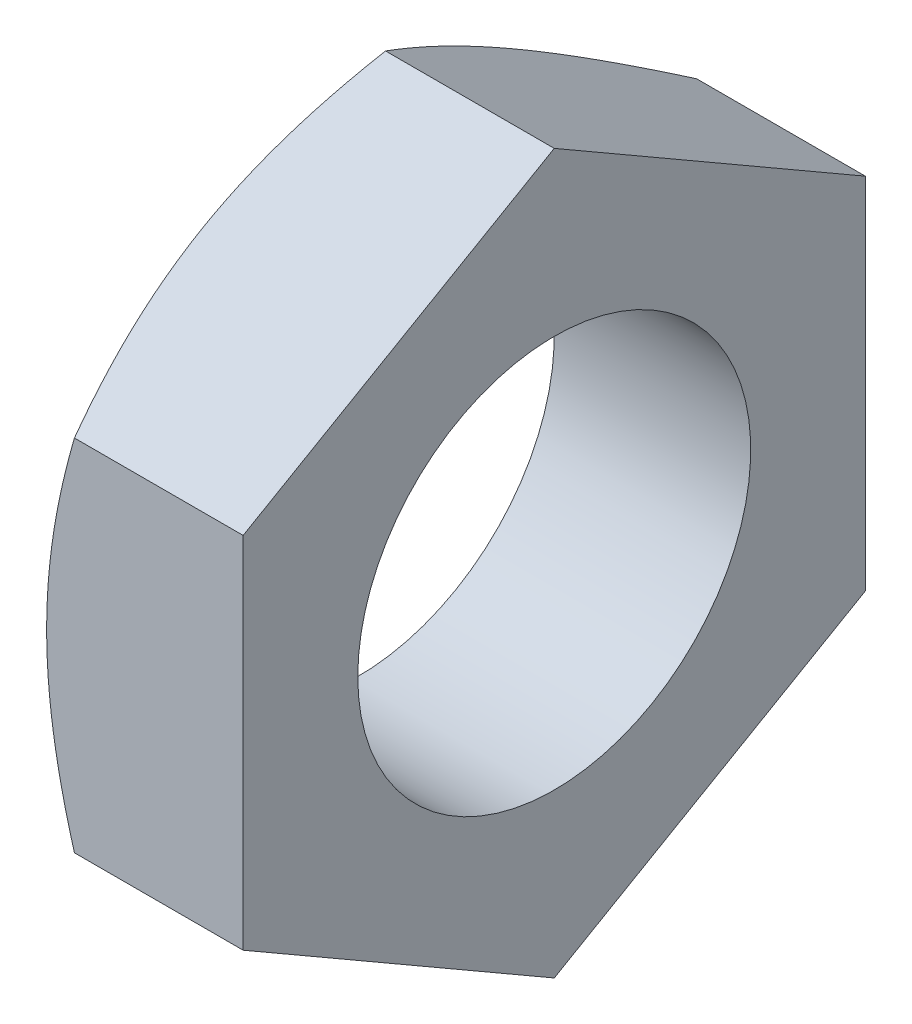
ISO-10303-21;
HEADER;
FILE_DESCRIPTION(('STEP AP214'),'2;1');
FILE_NAME('part.step','',(''),(''),'','','');
FILE_SCHEMA(('AUTOMOTIVE_DESIGN { 1 0 10303 214 1 1 1 1 }'));
ENDSEC;
DATA;
#1=APPLICATION_CONTEXT('core data for automotive mechanical design processes');
#2=APPLICATION_PROTOCOL_DEFINITION('international standard','automotive_design',2000,#1);
#3=PRODUCT_CONTEXT('',#1,'mechanical');
#4=PRODUCT('Part','Part','',(#3));
#5=PRODUCT_RELATED_PRODUCT_CATEGORY('part','',(#4));
#6=PRODUCT_DEFINITION_FORMATION('','',#4);
#7=PRODUCT_DEFINITION_CONTEXT('part definition',#1,'design');
#8=PRODUCT_DEFINITION('design','',#6,#7);
#9=PRODUCT_DEFINITION_SHAPE('','',#8);
#10=(LENGTH_UNIT() NAMED_UNIT(*) SI_UNIT(.MILLI.,.METRE.));
#11=(NAMED_UNIT(*) PLANE_ANGLE_UNIT() SI_UNIT($,.RADIAN.));
#12=(NAMED_UNIT(*) SI_UNIT($,.STERADIAN.) SOLID_ANGLE_UNIT());
#13=UNCERTAINTY_MEASURE_WITH_UNIT(LENGTH_MEASURE(1.E-05),#10,'distance_accuracy_value','');
#14=(GEOMETRIC_REPRESENTATION_CONTEXT(3) GLOBAL_UNCERTAINTY_ASSIGNED_CONTEXT((#13)) GLOBAL_UNIT_ASSIGNED_CONTEXT((#10,
#11,#12)) REPRESENTATION_CONTEXT('',''));
#15=CARTESIAN_POINT('',(0.,0.,0.));
#16=DIRECTION('',(0.,0.,1.));
#17=DIRECTION('',(1.,0.,0.));
#18=AXIS2_PLACEMENT_3D('',#15,#16,#17);
#19=CARTESIAN_POINT('',(6.,5.48482755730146,-9.5));
#20=DIRECTION('',(0.,-0.866025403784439,0.499999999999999));
#21=DIRECTION('',(0.,-0.499999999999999,-0.866025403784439));
#22=AXIS2_PLACEMENT_3D('',#19,#20,#21);
#23=PLANE('',#22);
#24=CARTESIAN_POINT('',(0.848572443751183,10.9697705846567,0.0002));
#25=CARTESIAN_POINT('',(0.778973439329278,10.8492020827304,-0.2086307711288));
#26=CARTESIAN_POINT('',(0.712533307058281,10.7281840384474,-0.418240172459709));
#27=CARTESIAN_POINT('',(0.586847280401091,10.4851774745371,-0.839139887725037));
#28=CARTESIAN_POINT('',(0.527603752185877,10.3631886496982,-1.05043073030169));
#29=CARTESIAN_POINT('',(0.361814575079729,9.99525656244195,-1.68770779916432));
#30=CARTESIAN_POINT('',(0.267514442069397,9.74786083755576,-2.11620976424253));
#31=CARTESIAN_POINT('',(0.156938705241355,9.37764446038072,-2.75744333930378));
#32=CARTESIAN_POINT('',(0.125439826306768,9.2559298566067,-2.9682592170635));
#33=CARTESIAN_POINT('',(0.0726182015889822,9.01193711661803,-3.39086703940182));
#34=CARTESIAN_POINT('',(0.051295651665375,8.88965896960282,-3.60265900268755));
#35=CARTESIAN_POINT('',(0.0193730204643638,8.64489870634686,-4.0265962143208));
#36=CARTESIAN_POINT('',(0.00876019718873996,8.52241700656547,-4.23874074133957));
#37=CARTESIAN_POINT('',(-0.0015174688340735,8.27734047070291,-4.6632257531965));
#38=CARTESIAN_POINT('',(-0.00118264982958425,8.15474563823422,-4.87556623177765));
#39=CARTESIAN_POINT('',(0.00967336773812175,7.92555157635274,-5.27254199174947));
#40=CARTESIAN_POINT('',(0.018870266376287,7.81893617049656,-5.45720529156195));
#41=CARTESIAN_POINT('',(0.0453653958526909,7.60595470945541,-5.82610000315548));
#42=CARTESIAN_POINT('',(0.0626641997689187,7.49958867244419,-6.01033138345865));
#43=CARTESIAN_POINT('',(0.126304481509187,7.18090270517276,-6.56231167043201));
#44=CARTESIAN_POINT('',(0.184381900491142,6.96914687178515,-6.92908353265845));
#45=CARTESIAN_POINT('',(0.329576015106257,6.54338898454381,-7.66651782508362));
#46=CARTESIAN_POINT('',(0.417308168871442,6.32944126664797,-8.03708614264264));
#47=CARTESIAN_POINT('',(0.61642373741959,5.90473630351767,-8.77269671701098));
#48=CARTESIAN_POINT('',(0.72776038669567,5.6939736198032,-9.13774839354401));
#49=CARTESIAN_POINT('',(0.848572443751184,5.48471208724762,-9.5002));
#50=B_SPLINE_CURVE_WITH_KNOTS('',3,(#24,#25,#26,#27,#28,#29,#30,#31,#32,#33,#34,#35,#36,#37,#38,
#39,#40,#41,#42,#43,#44,#45,#46,#47,#48,#49),.UNSPECIFIED.,.F.,.F.,(4,2,2,2,2,2,2,2,2,2,2,2,4),
(0.,0.752880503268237,1.50600787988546,3.01546870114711,3.75167336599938,4.48789219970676,
5.22323407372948,5.95855322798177,6.59868084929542,7.23885375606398,8.52010929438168,
9.82978009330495,11.1368800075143),.UNSPECIFIED.);
#51=CARTESIAN_POINT('',(0.848505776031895,10.9696551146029,0.));
#52=VERTEX_POINT('',#51);
#53=CARTESIAN_POINT('',(0.,8.22724133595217,-4.74999999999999));
#54=VERTEX_POINT('',#53);
#55=EDGE_CURVE('E118',#52,#54,#50,.T.);
#56=ORIENTED_EDGE('',*,*,#55,.F.);
#57=DIRECTION('',(-1.,0.,0.));
#58=VECTOR('',#57,1.);
#59=CARTESIAN_POINT('',(6.,10.9696551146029,0.));
#60=LINE('',#59,#58);
#61=CARTESIAN_POINT('',(6.,10.9696551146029,0.));
#62=VERTEX_POINT('',#61);
#63=EDGE_CURVE('E131',#62,#52,#60,.T.);
#64=ORIENTED_EDGE('',*,*,#63,.F.);
#65=DIRECTION('',(0.,0.499999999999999,0.866025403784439));
#66=VECTOR('',#65,1.);
#67=CARTESIAN_POINT('',(6.,5.48482755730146,-9.5));
#68=LINE('',#67,#66);
#69=CARTESIAN_POINT('',(6.,5.48482755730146,-9.5));
#70=VERTEX_POINT('',#69);
#71=EDGE_CURVE('E132',#70,#62,#68,.T.);
#72=ORIENTED_EDGE('',*,*,#71,.F.);
#73=DIRECTION('',(-1.,0.,0.));
#74=VECTOR('',#73,1.);
#75=CARTESIAN_POINT('',(6.,5.48482755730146,-9.5));
#76=LINE('',#75,#74);
#77=CARTESIAN_POINT('',(0.848505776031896,5.48482755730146,-9.5));
#78=VERTEX_POINT('',#77);
#79=EDGE_CURVE('E216',#70,#78,#76,.T.);
#80=ORIENTED_EDGE('',*,*,#79,.T.);
#81=EDGE_CURVE('E182',#54,#78,#50,.T.);
#82=ORIENTED_EDGE('',*,*,#81,.F.);
#83=EDGE_LOOP('',(#56,#64,#72,#80,#82));
#84=FACE_BOUND('',#83,.T.);
#85=ADVANCED_FACE('F35',(#84),#23,.F.);
#86=CARTESIAN_POINT('',(6.,5.48482755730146,9.5));
#87=DIRECTION('',(0.,0.866025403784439,0.499999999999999));
#88=DIRECTION('',(0.,-0.499999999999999,0.866025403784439));
#89=AXIS2_PLACEMENT_3D('',#86,#87,#88);
#90=PLANE('',#89);
#91=ORIENTED_EDGE('',*,*,#63,.T.);
#92=CARTESIAN_POINT('',(0.848572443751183,10.9697705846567,-0.0002));
#93=CARTESIAN_POINT('',(0.778973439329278,10.8492020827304,0.2086307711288));
#94=CARTESIAN_POINT('',(0.712533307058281,10.7281840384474,0.418240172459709));
#95=CARTESIAN_POINT('',(0.586847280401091,10.4851774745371,0.839139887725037));
#96=CARTESIAN_POINT('',(0.527603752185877,10.3631886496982,1.05043073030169));
#97=CARTESIAN_POINT('',(0.361814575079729,9.99525656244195,1.68770779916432));
#98=CARTESIAN_POINT('',(0.267514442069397,9.74786083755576,2.11620976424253));
#99=CARTESIAN_POINT('',(0.156938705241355,9.37764446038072,2.75744333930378));
#100=CARTESIAN_POINT('',(0.125439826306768,9.2559298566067,2.9682592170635));
#101=CARTESIAN_POINT('',(0.0726182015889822,9.01193711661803,3.39086703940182));
#102=CARTESIAN_POINT('',(0.051295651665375,8.88965896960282,3.60265900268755));
#103=CARTESIAN_POINT('',(0.0193730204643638,8.64489870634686,4.0265962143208));
#104=CARTESIAN_POINT('',(0.00876019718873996,8.52241700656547,4.23874074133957));
#105=CARTESIAN_POINT('',(-0.0015174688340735,8.27734047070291,4.6632257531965));
#106=CARTESIAN_POINT('',(-0.00118264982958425,8.15474563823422,4.87556623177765));
#107=CARTESIAN_POINT('',(0.00967336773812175,7.92555157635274,5.27254199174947));
#108=CARTESIAN_POINT('',(0.018870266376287,7.81893617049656,5.45720529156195));
#109=CARTESIAN_POINT('',(0.0453653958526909,7.60595470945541,5.82610000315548));
#110=CARTESIAN_POINT('',(0.0626641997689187,7.49958867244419,6.01033138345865));
#111=CARTESIAN_POINT('',(0.126304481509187,7.18090270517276,6.56231167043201));
#112=CARTESIAN_POINT('',(0.184381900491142,6.96914687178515,6.92908353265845));
#113=CARTESIAN_POINT('',(0.329576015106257,6.54338898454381,7.66651782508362));
#114=CARTESIAN_POINT('',(0.417308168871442,6.32944126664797,8.03708614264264));
#115=CARTESIAN_POINT('',(0.61642373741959,5.90473630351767,8.77269671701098));
#116=CARTESIAN_POINT('',(0.72776038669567,5.6939736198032,9.13774839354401));
#117=CARTESIAN_POINT('',(0.848572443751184,5.48471208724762,9.5002));
#118=B_SPLINE_CURVE_WITH_KNOTS('',3,(#92,#93,#94,#95,#96,#97,#98,#99,#100,#101,#102,#103,#104,
#105,#106,#107,#108,#109,#110,#111,#112,#113,#114,#115,#116,#117),.UNSPECIFIED.,.F.,.F.,(4,2,2,
2,2,2,2,2,2,2,2,2,4),(0.,0.752880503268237,1.50600787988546,3.01546870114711,3.75167336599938,
4.48789219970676,5.22323407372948,5.95855322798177,6.59868084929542,7.23885375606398,
8.52010929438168,9.82978009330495,11.1368800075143),.UNSPECIFIED.);
#119=CARTESIAN_POINT('',(0.,8.22724133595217,4.74999999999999));
#120=VERTEX_POINT('',#119);
#121=EDGE_CURVE('E113',#52,#120,#118,.T.);
#122=ORIENTED_EDGE('',*,*,#121,.T.);
#123=CARTESIAN_POINT('',(0.848505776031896,5.48482755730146,9.5));
#124=VERTEX_POINT('',#123);
#125=EDGE_CURVE('E105',#120,#124,#118,.T.);
#126=ORIENTED_EDGE('',*,*,#125,.T.);
#127=DIRECTION('',(-1.,0.,0.));
#128=VECTOR('',#127,1.);
#129=CARTESIAN_POINT('',(6.,5.48482755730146,9.5));
#130=LINE('',#129,#128);
#131=CARTESIAN_POINT('',(6.,5.48482755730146,9.5));
#132=VERTEX_POINT('',#131);
#133=EDGE_CURVE('E202',#132,#124,#130,.T.);
#134=ORIENTED_EDGE('',*,*,#133,.F.);
#135=DIRECTION('',(0.,0.499999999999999,-0.866025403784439));
#136=VECTOR('',#135,1.);
#137=CARTESIAN_POINT('',(6.,5.48482755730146,9.5));
#138=LINE('',#137,#136);
#139=EDGE_CURVE('E133',#132,#62,#138,.T.);
#140=ORIENTED_EDGE('',*,*,#139,.T.);
#141=EDGE_LOOP('',(#91,#122,#126,#134,#140));
#142=FACE_BOUND('',#141,.T.);
#143=ADVANCED_FACE('F128',(#142),#90,.T.);
#144=CARTESIAN_POINT('',(6.,-5.48482755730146,9.5));
#145=DIRECTION('',(0.,0.,1.));
#146=DIRECTION('',(1.,0.,0.));
#147=AXIS2_PLACEMENT_3D('',#144,#145,#146);
#148=PLANE('',#147);
#149=ORIENTED_EDGE('',*,*,#133,.T.);
#150=CARTESIAN_POINT('',(4.69172618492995,-14.8471121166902,9.5));
#151=CARTESIAN_POINT('',(4.59058850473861,-14.6391417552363,9.5));
#152=CARTESIAN_POINT('',(4.48994664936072,-14.4309303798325,9.5));
#153=CARTESIAN_POINT('',(4.28976668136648,-14.0139753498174,9.5));
#154=CARTESIAN_POINT('',(4.19022857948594,-13.805231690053,9.5));
#155=CARTESIAN_POINT('',(3.89341251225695,-13.1780728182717,9.5));
#156=CARTESIAN_POINT('',(3.6979619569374,-12.7587895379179,9.5));
#157=CARTESIAN_POINT('',(3.31206700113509,-11.9152275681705,9.5));
#158=CARTESIAN_POINT('',(3.12165465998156,-11.4909341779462,9.5));
#159=CARTESIAN_POINT('',(2.74846992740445,-10.6390125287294,9.5));
#160=CARTESIAN_POINT('',(2.56569718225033,-10.2113844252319,9.5));
#161=CARTESIAN_POINT('',(2.20396235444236,-9.33799352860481,9.5));
#162=CARTESIAN_POINT('',(2.02532268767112,-8.8920964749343,9.5));
#163=CARTESIAN_POINT('',(1.68128876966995,-7.99512951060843,9.5));
#164=CARTESIAN_POINT('',(1.51589598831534,-7.54405903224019,9.5));
#165=CARTESIAN_POINT('',(1.20261406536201,-6.63682943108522,9.5));
#166=CARTESIAN_POINT('',(1.05469048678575,-6.18068232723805,9.5));
#167=CARTESIAN_POINT('',(0.781015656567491,-5.2618624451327,9.5));
#168=CARTESIAN_POINT('',(0.655257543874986,-4.79919173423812,9.5));
#169=CARTESIAN_POINT('',(0.432539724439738,-3.86951545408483,9.5));
#170=CARTESIAN_POINT('',(0.335423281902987,-3.40254846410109,9.5));
#171=CARTESIAN_POINT('',(0.215389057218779,-2.69775633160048,9.5));
#172=CARTESIAN_POINT('',(0.179649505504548,-2.46208592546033,9.5));
#173=CARTESIAN_POINT('',(0.117415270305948,-1.98953527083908,9.5));
#174=CARTESIAN_POINT('',(0.0909196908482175,-1.75265514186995,9.5));
#175=CARTESIAN_POINT('',(0.0480398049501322,-1.28114863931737,9.5));
#176=CARTESIAN_POINT('',(0.031525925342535,-1.04653409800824,9.5));
#177=CARTESIAN_POINT('',(0.00844001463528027,-0.576816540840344,9.5));
#178=CARTESIAN_POINT('',(0.00186781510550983,-0.341713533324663,9.5));
#179=CARTESIAN_POINT('',(-0.00117754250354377,0.128561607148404,9.5));
#180=CARTESIAN_POINT('',(0.00234938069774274,0.363733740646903,9.5));
#181=CARTESIAN_POINT('',(0.0194147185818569,0.833717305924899,9.5));
#182=CARTESIAN_POINT('',(0.0329536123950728,1.06852871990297,9.5));
#183=CARTESIAN_POINT('',(0.0769544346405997,1.62932022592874,9.5));
#184=CARTESIAN_POINT('',(0.111970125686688,1.95495087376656,9.5));
#185=CARTESIAN_POINT('',(0.199372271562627,2.60385539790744,9.5));
#186=CARTESIAN_POINT('',(0.251760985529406,2.92712896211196,9.5));
#187=CARTESIAN_POINT('',(0.432213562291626,3.89300157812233,9.5));
#188=CARTESIAN_POINT('',(0.58353394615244,4.53131648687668,9.5));
#189=CARTESIAN_POINT('',(0.846757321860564,5.48613141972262,9.5));
#190=CARTESIAN_POINT('',(0.941821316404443,5.80755871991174,9.5));
#191=CARTESIAN_POINT('',(1.14202083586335,6.44729226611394,9.5));
#192=CARTESIAN_POINT('',(1.24715643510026,6.76559848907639,9.5));
#193=CARTESIAN_POINT('',(1.46579559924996,7.39918937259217,9.5));
#194=CARTESIAN_POINT('',(1.57929662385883,7.71447491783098,9.5));
#195=CARTESIAN_POINT('',(1.81331117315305,8.34241730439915,9.5));
#196=CARTESIAN_POINT('',(1.93382455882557,8.65507419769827,9.5));
#197=CARTESIAN_POINT('',(2.25739436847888,9.4716015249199,9.5));
#198=CARTESIAN_POINT('',(2.46521460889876,9.97358204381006,9.5));
#199=CARTESIAN_POINT('',(2.89243720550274,10.9726074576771,9.5));
#200=CARTESIAN_POINT('',(3.11184067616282,11.4696518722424,9.5));
#201=CARTESIAN_POINT('',(3.55958272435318,12.4598895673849,9.5));
#202=CARTESIAN_POINT('',(3.78792429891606,12.9530814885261,9.5));
#203=CARTESIAN_POINT('',(4.25148068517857,13.9361932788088,9.5));
#204=CARTESIAN_POINT('',(4.48669525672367,14.4261132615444,9.5));
#205=CARTESIAN_POINT('',(4.96289679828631,15.4040219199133,9.5));
#206=CARTESIAN_POINT('',(5.20389171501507,15.8920067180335,9.5));
#207=CARTESIAN_POINT('',(5.69023026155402,16.8658052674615,9.5));
#208=CARTESIAN_POINT('',(5.93557392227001,17.3516190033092,9.5));
#209=CARTESIAN_POINT('',(6.42973186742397,18.3213567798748,9.5));
#210=CARTESIAN_POINT('',(6.67854546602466,18.8052811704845,9.5));
#211=CARTESIAN_POINT('',(7.17905937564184,19.7716356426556,9.5));
#212=CARTESIAN_POINT('',(7.43075969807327,20.2540657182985,9.5));
#213=CARTESIAN_POINT('',(8.13863796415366,21.6027155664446,9.5));
#214=CARTESIAN_POINT('',(8.5974766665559,22.4675385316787,9.5));
#215=CARTESIAN_POINT('',(9.52078327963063,24.1942274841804,9.5));
#216=CARTESIAN_POINT('',(9.98525149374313,25.0560933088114,9.5));
#217=CARTESIAN_POINT('',(10.9169584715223,26.7748564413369,9.5));
#218=CARTESIAN_POINT('',(11.3841841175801,27.6317608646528,9.5));
#219=CARTESIAN_POINT('',(12.0874308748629,28.9157573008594,9.5));
#220=CARTESIAN_POINT('',(12.3222394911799,29.3435143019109,9.5));
#221=CARTESIAN_POINT('',(12.792576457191,30.1986317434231,9.5));
#222=CARTESIAN_POINT('',(13.0281048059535,30.625992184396,9.5));
#223=CARTESIAN_POINT('',(13.2639491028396,31.0531782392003,9.5));
#224=B_SPLINE_CURVE_WITH_KNOTS('',3,(#150,#151,#152,#153,#154,#155,#156,#157,#158,#159,#160,
#161,#162,#163,#164,#165,#166,#167,#168,#169,#170,#171,#172,#173,#174,#175,#176,#177,#178,#179,
#180,#181,#182,#183,#184,#185,#186,#187,#188,#189,#190,#191,#192,#193,#194,#195,#196,#197,#198,
#199,#200,#201,#202,#203,#204,#205,#206,#207,#208,#209,#210,#211,#212,#213,#214,#215,#216,#217,
#218,#219,#220,#221,#222,#223),.UNSPECIFIED.,.F.,.F.,(4,2,2,2,2,2,2,2,2,2,2,2,2,2,2,2,2,2,2,2,2,
2,2,2,2,2,2,2,2,2,2,2,2,2,2,2,4),(0.,0.693774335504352,1.38755541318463,2.77531723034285,
4.170441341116,5.56550078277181,7.0063880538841,8.44743498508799,9.88559201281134,
11.3233030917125,12.7529940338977,13.467936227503,14.1828091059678,14.8881908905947,
15.5935607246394,16.2989362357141,17.0043455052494,17.986316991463,18.9684162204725,
20.9336223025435,21.9391067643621,22.9445986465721,23.949786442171,24.9549543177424,
26.5846383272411,28.2144794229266,29.8448717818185,31.4752072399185,33.107929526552,
34.7406634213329,36.3730790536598,38.005501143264,40.9424853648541,43.8796286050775,
46.8076327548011,48.2715312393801,49.7354278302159),.UNSPECIFIED.);
#225=CARTESIAN_POINT('',(0.,0.,9.5));
#226=VERTEX_POINT('',#225);
#227=EDGE_CURVE('E109',#124,#226,#224,.F.);
#228=ORIENTED_EDGE('',*,*,#227,.T.);
#229=CARTESIAN_POINT('',(0.848505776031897,-5.48482755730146,9.5));
#230=VERTEX_POINT('',#229);
#231=EDGE_CURVE('E140',#226,#230,#224,.F.);
#232=ORIENTED_EDGE('',*,*,#231,.T.);
#233=DIRECTION('',(-1.,0.,0.));
#234=VECTOR('',#233,1.);
#235=CARTESIAN_POINT('',(6.,-5.48482755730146,9.5));
#236=LINE('',#235,#234);
#237=CARTESIAN_POINT('',(6.,-5.48482755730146,9.5));
#238=VERTEX_POINT('',#237);
#239=EDGE_CURVE('E206',#238,#230,#236,.T.);
#240=ORIENTED_EDGE('',*,*,#239,.F.);
#241=DIRECTION('',(0.,1.,0.));
#242=VECTOR('',#241,1.);
#243=CARTESIAN_POINT('',(6.,-5.48482755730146,9.5));
#244=LINE('',#243,#242);
#245=EDGE_CURVE('E204',#238,#132,#244,.T.);
#246=ORIENTED_EDGE('',*,*,#245,.T.);
#247=EDGE_LOOP('',(#149,#228,#232,#240,#246));
#248=FACE_BOUND('',#247,.T.);
#249=ADVANCED_FACE('F200',(#248),#148,.T.);
#250=CARTESIAN_POINT('',(6.,-5.48482755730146,9.5));
#251=DIRECTION('',(0.,0.866025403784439,-0.499999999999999));
#252=DIRECTION('',(0.,0.499999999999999,0.866025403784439));
#253=AXIS2_PLACEMENT_3D('',#250,#251,#252);
#254=PLANE('',#253);
#255=CARTESIAN_POINT('',(0.848572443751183,-10.9697705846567,-0.0002));
#256=CARTESIAN_POINT('',(0.778973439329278,-10.8492020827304,0.2086307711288));
#257=CARTESIAN_POINT('',(0.712533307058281,-10.7281840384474,0.418240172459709));
#258=CARTESIAN_POINT('',(0.586847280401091,-10.4851774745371,0.839139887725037));
#259=CARTESIAN_POINT('',(0.527603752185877,-10.3631886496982,1.05043073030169));
#260=CARTESIAN_POINT('',(0.361814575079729,-9.99525656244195,1.68770779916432));
#261=CARTESIAN_POINT('',(0.267514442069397,-9.74786083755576,2.11620976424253));
#262=CARTESIAN_POINT('',(0.156938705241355,-9.37764446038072,2.75744333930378));
#263=CARTESIAN_POINT('',(0.125439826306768,-9.2559298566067,2.9682592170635));
#264=CARTESIAN_POINT('',(0.0726182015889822,-9.01193711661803,3.39086703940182));
#265=CARTESIAN_POINT('',(0.051295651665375,-8.88965896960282,3.60265900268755));
#266=CARTESIAN_POINT('',(0.0193730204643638,-8.64489870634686,4.0265962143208));
#267=CARTESIAN_POINT('',(0.00876019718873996,-8.52241700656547,4.23874074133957));
#268=CARTESIAN_POINT('',(-0.0015174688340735,-8.27734047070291,4.6632257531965));
#269=CARTESIAN_POINT('',(-0.00118264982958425,-8.15474563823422,4.87556623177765));
#270=CARTESIAN_POINT('',(0.00967336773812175,-7.92555157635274,5.27254199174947));
#271=CARTESIAN_POINT('',(0.018870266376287,-7.81893617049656,5.45720529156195));
#272=CARTESIAN_POINT('',(0.0453653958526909,-7.60595470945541,5.82610000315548));
#273=CARTESIAN_POINT('',(0.0626641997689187,-7.49958867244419,6.01033138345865));
#274=CARTESIAN_POINT('',(0.126304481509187,-7.18090270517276,6.56231167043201));
#275=CARTESIAN_POINT('',(0.184381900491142,-6.96914687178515,6.92908353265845));
#276=CARTESIAN_POINT('',(0.329576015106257,-6.54338898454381,7.66651782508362));
#277=CARTESIAN_POINT('',(0.417308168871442,-6.32944126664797,8.03708614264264));
#278=CARTESIAN_POINT('',(0.61642373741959,-5.90473630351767,8.77269671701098));
#279=CARTESIAN_POINT('',(0.72776038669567,-5.6939736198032,9.13774839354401));
#280=CARTESIAN_POINT('',(0.848572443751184,-5.48471208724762,9.5002));
#281=B_SPLINE_CURVE_WITH_KNOTS('',3,(#255,#256,#257,#258,#259,#260,#261,#262,#263,#264,#265,
#266,#267,#268,#269,#270,#271,#272,#273,#274,#275,#276,#277,#278,#279,#280),.UNSPECIFIED.,.F.,
.F.,(4,2,2,2,2,2,2,2,2,2,2,2,4),(0.,0.752880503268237,1.50600787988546,3.01546870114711,
3.75167336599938,4.48789219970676,5.22323407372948,5.95855322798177,6.59868084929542,
7.23885375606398,8.52010929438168,9.82978009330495,11.1368800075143),.UNSPECIFIED.);
#282=CARTESIAN_POINT('',(0.848505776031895,-10.9696551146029,0.));
#283=VERTEX_POINT('',#282);
#284=CARTESIAN_POINT('',(0.,-8.22724133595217,4.74999999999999));
#285=VERTEX_POINT('',#284);
#286=EDGE_CURVE('E177',#283,#285,#281,.T.);
#287=ORIENTED_EDGE('',*,*,#286,.F.);
#288=DIRECTION('',(-1.,0.,0.));
#289=VECTOR('',#288,1.);
#290=CARTESIAN_POINT('',(6.,-10.9696551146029,0.));
#291=LINE('',#290,#289);
#292=CARTESIAN_POINT('',(6.,-10.9696551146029,0.));
#293=VERTEX_POINT('',#292);
#294=EDGE_CURVE('E208',#293,#283,#291,.T.);
#295=ORIENTED_EDGE('',*,*,#294,.F.);
#296=DIRECTION('',(0.,-0.499999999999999,-0.866025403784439));
#297=VECTOR('',#296,1.);
#298=CARTESIAN_POINT('',(6.,-5.48482755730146,9.5));
#299=LINE('',#298,#297);
#300=EDGE_CURVE('E224',#238,#293,#299,.T.);
#301=ORIENTED_EDGE('',*,*,#300,.F.);
#302=ORIENTED_EDGE('',*,*,#239,.T.);
#303=EDGE_CURVE('E189',#285,#230,#281,.T.);
#304=ORIENTED_EDGE('',*,*,#303,.F.);
#305=EDGE_LOOP('',(#287,#295,#301,#302,#304));
#306=FACE_BOUND('',#305,.T.);
#307=ADVANCED_FACE('F243',(#306),#254,.F.);
#308=CARTESIAN_POINT('',(6.,-5.48482755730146,-9.5));
#309=DIRECTION('',(0.,-0.866025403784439,-0.499999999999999));
#310=DIRECTION('',(0.,0.499999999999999,-0.866025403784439));
#311=AXIS2_PLACEMENT_3D('',#308,#309,#310);
#312=PLANE('',#311);
#313=ORIENTED_EDGE('',*,*,#294,.T.);
#314=CARTESIAN_POINT('',(0.848572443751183,-10.9697705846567,0.0002));
#315=CARTESIAN_POINT('',(0.778973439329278,-10.8492020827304,-0.2086307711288));
#316=CARTESIAN_POINT('',(0.712533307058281,-10.7281840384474,-0.418240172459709));
#317=CARTESIAN_POINT('',(0.586847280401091,-10.4851774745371,-0.839139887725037));
#318=CARTESIAN_POINT('',(0.527603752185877,-10.3631886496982,-1.05043073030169));
#319=CARTESIAN_POINT('',(0.361814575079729,-9.99525656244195,-1.68770779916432));
#320=CARTESIAN_POINT('',(0.267514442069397,-9.74786083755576,-2.11620976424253));
#321=CARTESIAN_POINT('',(0.156938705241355,-9.37764446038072,-2.75744333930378));
#322=CARTESIAN_POINT('',(0.125439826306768,-9.2559298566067,-2.9682592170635));
#323=CARTESIAN_POINT('',(0.0726182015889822,-9.01193711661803,-3.39086703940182));
#324=CARTESIAN_POINT('',(0.051295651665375,-8.88965896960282,-3.60265900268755));
#325=CARTESIAN_POINT('',(0.0193730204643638,-8.64489870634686,-4.0265962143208));
#326=CARTESIAN_POINT('',(0.00876019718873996,-8.52241700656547,-4.23874074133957));
#327=CARTESIAN_POINT('',(-0.0015174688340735,-8.27734047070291,-4.6632257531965));
#328=CARTESIAN_POINT('',(-0.00118264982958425,-8.15474563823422,-4.87556623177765));
#329=CARTESIAN_POINT('',(0.00967336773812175,-7.92555157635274,-5.27254199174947));
#330=CARTESIAN_POINT('',(0.018870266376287,-7.81893617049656,-5.45720529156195));
#331=CARTESIAN_POINT('',(0.0453653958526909,-7.60595470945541,-5.82610000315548));
#332=CARTESIAN_POINT('',(0.0626641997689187,-7.49958867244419,-6.01033138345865));
#333=CARTESIAN_POINT('',(0.126304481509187,-7.18090270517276,-6.56231167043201));
#334=CARTESIAN_POINT('',(0.184381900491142,-6.96914687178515,-6.92908353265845));
#335=CARTESIAN_POINT('',(0.329576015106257,-6.54338898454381,-7.66651782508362));
#336=CARTESIAN_POINT('',(0.417308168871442,-6.32944126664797,-8.03708614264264));
#337=CARTESIAN_POINT('',(0.61642373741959,-5.90473630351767,-8.77269671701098));
#338=CARTESIAN_POINT('',(0.72776038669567,-5.6939736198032,-9.13774839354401));
#339=CARTESIAN_POINT('',(0.848572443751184,-5.48471208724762,-9.5002));
#340=B_SPLINE_CURVE_WITH_KNOTS('',3,(#314,#315,#316,#317,#318,#319,#320,#321,#322,#323,#324,
#325,#326,#327,#328,#329,#330,#331,#332,#333,#334,#335,#336,#337,#338,#339),.UNSPECIFIED.,.F.,
.F.,(4,2,2,2,2,2,2,2,2,2,2,2,4),(0.,0.752880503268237,1.50600787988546,3.01546870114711,
3.75167336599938,4.48789219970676,5.22323407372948,5.95855322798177,6.59868084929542,
7.23885375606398,8.52010929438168,9.82978009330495,11.1368800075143),.UNSPECIFIED.);
#341=CARTESIAN_POINT('',(0.,-8.22724133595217,-4.74999999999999));
#342=VERTEX_POINT('',#341);
#343=EDGE_CURVE('E190',#283,#342,#340,.T.);
#344=ORIENTED_EDGE('',*,*,#343,.T.);
#345=CARTESIAN_POINT('',(0.848505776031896,-5.48482755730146,-9.5));
#346=VERTEX_POINT('',#345);
#347=EDGE_CURVE('E170',#342,#346,#340,.T.);
#348=ORIENTED_EDGE('',*,*,#347,.T.);
#349=DIRECTION('',(-1.,0.,0.));
#350=VECTOR('',#349,1.);
#351=CARTESIAN_POINT('',(6.,-5.48482755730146,-9.5));
#352=LINE('',#351,#350);
#353=CARTESIAN_POINT('',(6.,-5.48482755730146,-9.5));
#354=VERTEX_POINT('',#353);
#355=EDGE_CURVE('E213',#354,#346,#352,.T.);
#356=ORIENTED_EDGE('',*,*,#355,.F.);
#357=DIRECTION('',(0.,-0.499999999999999,0.866025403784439));
#358=VECTOR('',#357,1.);
#359=CARTESIAN_POINT('',(6.,-5.48482755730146,-9.5));
#360=LINE('',#359,#358);
#361=EDGE_CURVE('E221',#354,#293,#360,.T.);
#362=ORIENTED_EDGE('',*,*,#361,.T.);
#363=EDGE_LOOP('',(#313,#344,#348,#356,#362));
#364=FACE_BOUND('',#363,.T.);
#365=ADVANCED_FACE('F239',(#364),#312,.T.);
#366=CARTESIAN_POINT('',(6.,-5.48482755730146,-9.5));
#367=DIRECTION('',(0.,0.,1.));
#368=DIRECTION('',(1.,0.,0.));
#369=AXIS2_PLACEMENT_3D('',#366,#367,#368);
#370=PLANE('',#369);
#371=CARTESIAN_POINT('',(4.69172618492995,-14.8471121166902,-9.5));
#372=CARTESIAN_POINT('',(4.59058850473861,-14.6391417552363,-9.5));
#373=CARTESIAN_POINT('',(4.48994664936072,-14.4309303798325,-9.5));
#374=CARTESIAN_POINT('',(4.28976668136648,-14.0139753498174,-9.5));
#375=CARTESIAN_POINT('',(4.19022857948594,-13.805231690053,-9.5));
#376=CARTESIAN_POINT('',(3.89341251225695,-13.1780728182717,-9.5));
#377=CARTESIAN_POINT('',(3.6979619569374,-12.7587895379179,-9.5));
#378=CARTESIAN_POINT('',(3.31206700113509,-11.9152275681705,-9.5));
#379=CARTESIAN_POINT('',(3.12165465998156,-11.4909341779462,-9.5));
#380=CARTESIAN_POINT('',(2.74846992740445,-10.6390125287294,-9.5));
#381=CARTESIAN_POINT('',(2.56569718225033,-10.2113844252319,-9.5));
#382=CARTESIAN_POINT('',(2.20396235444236,-9.33799352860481,-9.5));
#383=CARTESIAN_POINT('',(2.02532268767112,-8.8920964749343,-9.5));
#384=CARTESIAN_POINT('',(1.68128876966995,-7.99512951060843,-9.5));
#385=CARTESIAN_POINT('',(1.51589598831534,-7.54405903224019,-9.5));
#386=CARTESIAN_POINT('',(1.20261406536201,-6.63682943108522,-9.5));
#387=CARTESIAN_POINT('',(1.05469048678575,-6.18068232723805,-9.5));
#388=CARTESIAN_POINT('',(0.781015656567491,-5.2618624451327,-9.5));
#389=CARTESIAN_POINT('',(0.655257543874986,-4.79919173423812,-9.5));
#390=CARTESIAN_POINT('',(0.432539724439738,-3.86951545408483,-9.5));
#391=CARTESIAN_POINT('',(0.335423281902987,-3.40254846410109,-9.5));
#392=CARTESIAN_POINT('',(0.215389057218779,-2.69775633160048,-9.5));
#393=CARTESIAN_POINT('',(0.179649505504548,-2.46208592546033,-9.5));
#394=CARTESIAN_POINT('',(0.117415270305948,-1.98953527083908,-9.5));
#395=CARTESIAN_POINT('',(0.0909196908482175,-1.75265514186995,-9.5));
#396=CARTESIAN_POINT('',(0.0480398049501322,-1.28114863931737,-9.5));
#397=CARTESIAN_POINT('',(0.031525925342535,-1.04653409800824,-9.5));
#398=CARTESIAN_POINT('',(0.00844001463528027,-0.576816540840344,-9.5));
#399=CARTESIAN_POINT('',(0.00186781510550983,-0.341713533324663,-9.5));
#400=CARTESIAN_POINT('',(-0.00117754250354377,0.128561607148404,-9.5));
#401=CARTESIAN_POINT('',(0.00234938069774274,0.363733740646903,-9.5));
#402=CARTESIAN_POINT('',(0.0194147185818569,0.833717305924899,-9.5));
#403=CARTESIAN_POINT('',(0.0329536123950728,1.06852871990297,-9.5));
#404=CARTESIAN_POINT('',(0.0769544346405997,1.62932022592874,-9.5));
#405=CARTESIAN_POINT('',(0.111970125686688,1.95495087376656,-9.5));
#406=CARTESIAN_POINT('',(0.199372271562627,2.60385539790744,-9.5));
#407=CARTESIAN_POINT('',(0.251760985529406,2.92712896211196,-9.5));
#408=CARTESIAN_POINT('',(0.432213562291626,3.89300157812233,-9.5));
#409=CARTESIAN_POINT('',(0.58353394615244,4.53131648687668,-9.5));
#410=CARTESIAN_POINT('',(0.846757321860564,5.48613141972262,-9.5));
#411=CARTESIAN_POINT('',(0.941821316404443,5.80755871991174,-9.5));
#412=CARTESIAN_POINT('',(1.14202083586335,6.44729226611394,-9.5));
#413=CARTESIAN_POINT('',(1.24715643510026,6.76559848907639,-9.5));
#414=CARTESIAN_POINT('',(1.46579559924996,7.39918937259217,-9.5));
#415=CARTESIAN_POINT('',(1.57929662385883,7.71447491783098,-9.5));
#416=CARTESIAN_POINT('',(1.81331117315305,8.34241730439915,-9.5));
#417=CARTESIAN_POINT('',(1.93382455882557,8.65507419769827,-9.5));
#418=CARTESIAN_POINT('',(2.25739436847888,9.4716015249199,-9.5));
#419=CARTESIAN_POINT('',(2.46521460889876,9.97358204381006,-9.5));
#420=CARTESIAN_POINT('',(2.89243720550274,10.9726074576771,-9.5));
#421=CARTESIAN_POINT('',(3.11184067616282,11.4696518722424,-9.5));
#422=CARTESIAN_POINT('',(3.55958272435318,12.4598895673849,-9.5));
#423=CARTESIAN_POINT('',(3.78792429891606,12.9530814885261,-9.5));
#424=CARTESIAN_POINT('',(4.25148068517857,13.9361932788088,-9.5));
#425=CARTESIAN_POINT('',(4.48669525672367,14.4261132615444,-9.5));
#426=CARTESIAN_POINT('',(4.96289679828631,15.4040219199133,-9.5));
#427=CARTESIAN_POINT('',(5.20389171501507,15.8920067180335,-9.5));
#428=CARTESIAN_POINT('',(5.69023026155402,16.8658052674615,-9.5));
#429=CARTESIAN_POINT('',(5.93557392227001,17.3516190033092,-9.5));
#430=CARTESIAN_POINT('',(6.42973186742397,18.3213567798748,-9.5));
#431=CARTESIAN_POINT('',(6.67854546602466,18.8052811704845,-9.5));
#432=CARTESIAN_POINT('',(7.17905937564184,19.7716356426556,-9.5));
#433=CARTESIAN_POINT('',(7.43075969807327,20.2540657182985,-9.5));
#434=CARTESIAN_POINT('',(8.13863796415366,21.6027155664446,-9.5));
#435=CARTESIAN_POINT('',(8.5974766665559,22.4675385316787,-9.5));
#436=CARTESIAN_POINT('',(9.52078327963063,24.1942274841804,-9.5));
#437=CARTESIAN_POINT('',(9.98525149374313,25.0560933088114,-9.5));
#438=CARTESIAN_POINT('',(10.9169584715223,26.7748564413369,-9.5));
#439=CARTESIAN_POINT('',(11.3841841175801,27.6317608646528,-9.5));
#440=CARTESIAN_POINT('',(12.0874308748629,28.9157573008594,-9.5));
#441=CARTESIAN_POINT('',(12.3222394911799,29.3435143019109,-9.5));
#442=CARTESIAN_POINT('',(12.792576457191,30.1986317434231,-9.5));
#443=CARTESIAN_POINT('',(13.0281048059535,30.625992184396,-9.5));
#444=CARTESIAN_POINT('',(13.2639491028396,31.0531782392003,-9.5));
#445=B_SPLINE_CURVE_WITH_KNOTS('',3,(#371,#372,#373,#374,#375,#376,#377,#378,#379,#380,#381,
#382,#383,#384,#385,#386,#387,#388,#389,#390,#391,#392,#393,#394,#395,#396,#397,#398,#399,#400,
#401,#402,#403,#404,#405,#406,#407,#408,#409,#410,#411,#412,#413,#414,#415,#416,#417,#418,#419,
#420,#421,#422,#423,#424,#425,#426,#427,#428,#429,#430,#431,#432,#433,#434,#435,#436,#437,#438,
#439,#440,#441,#442,#443,#444),.UNSPECIFIED.,.F.,.F.,(4,2,2,2,2,2,2,2,2,2,2,2,2,2,2,2,2,2,2,2,2,
2,2,2,2,2,2,2,2,2,2,2,2,2,2,2,4),(0.,0.693774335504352,1.38755541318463,2.77531723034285,
4.170441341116,5.56550078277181,7.0063880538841,8.44743498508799,9.88559201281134,
11.3233030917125,12.7529940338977,13.467936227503,14.1828091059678,14.8881908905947,
15.5935607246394,16.2989362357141,17.0043455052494,17.986316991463,18.9684162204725,
20.9336223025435,21.9391067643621,22.9445986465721,23.949786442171,24.9549543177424,
26.5846383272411,28.2144794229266,29.8448717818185,31.4752072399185,33.107929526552,
34.7406634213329,36.3730790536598,38.005501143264,40.9424853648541,43.8796286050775,
46.8076327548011,48.2715312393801,49.7354278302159),.UNSPECIFIED.);
#446=CARTESIAN_POINT('',(0.,0.,-9.5));
#447=VERTEX_POINT('',#446);
#448=EDGE_CURVE('E235',#78,#447,#445,.F.);
#449=ORIENTED_EDGE('',*,*,#448,.F.);
#450=ORIENTED_EDGE('',*,*,#79,.F.);
#451=DIRECTION('',(0.,1.,0.));
#452=VECTOR('',#451,1.);
#453=CARTESIAN_POINT('',(6.,-5.48482755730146,-9.5));
#454=LINE('',#453,#452);
#455=EDGE_CURVE('E219',#354,#70,#454,.T.);
#456=ORIENTED_EDGE('',*,*,#455,.F.);
#457=ORIENTED_EDGE('',*,*,#355,.T.);
#458=EDGE_CURVE('E124',#447,#346,#445,.F.);
#459=ORIENTED_EDGE('',*,*,#458,.F.);
#460=EDGE_LOOP('',(#449,#450,#456,#457,#459));
#461=FACE_BOUND('',#460,.T.);
#462=ADVANCED_FACE('F233',(#461),#370,.F.);
#463=CARTESIAN_POINT('',(6.,16.4544826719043,9.5));
#464=DIRECTION('',(-1.,0.,0.));
#465=DIRECTION('',(0.,0.,1.));
#466=AXIS2_PLACEMENT_3D('',#463,#464,#465);
#467=PLANE('',#466);
#468=CARTESIAN_POINT('',(6.,0.,0.));
#469=DIRECTION('',(-1.,0.,0.));
#470=DIRECTION('',(0.,0.,1.));
#471=AXIS2_PLACEMENT_3D('',#468,#469,#470);
#472=CIRCLE('',#471,6.);
#473=CARTESIAN_POINT('',(6.,0.,6.));
#474=VERTEX_POINT('',#473);
#475=EDGE_CURVE('E125',#474,#474,#472,.T.);
#476=ORIENTED_EDGE('',*,*,#475,.T.);
#477=EDGE_LOOP('',(#476));
#478=FACE_BOUND('',#477,.T.);
#479=ORIENTED_EDGE('',*,*,#71,.T.);
#480=ORIENTED_EDGE('',*,*,#139,.F.);
#481=ORIENTED_EDGE('',*,*,#245,.F.);
#482=ORIENTED_EDGE('',*,*,#300,.T.);
#483=ORIENTED_EDGE('',*,*,#361,.F.);
#484=ORIENTED_EDGE('',*,*,#455,.T.);
#485=EDGE_LOOP('',(#479,#480,#481,#482,#483,#484));
#486=FACE_BOUND('',#485,.T.);
#487=ADVANCED_FACE('F158',(#478,#486),#467,.F.);
#488=CARTESIAN_POINT('',(0.,0.,0.));
#489=DIRECTION('',(1.,0.,0.));
#490=DIRECTION('',(0.,0.,-1.));
#491=AXIS2_PLACEMENT_3D('',#488,#489,#490);
#492=CONICAL_SURFACE('',#491,9.5,1.0471975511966);
#493=CARTESIAN_POINT('',(0.,0.,0.));
#494=DIRECTION('',(-1.,0.,0.));
#495=DIRECTION('',(0.,0.,1.));
#496=AXIS2_PLACEMENT_3D('',#493,#494,#495);
#497=CIRCLE('',#496,9.5);
#498=EDGE_CURVE('E39',#285,#226,#497,.T.);
#499=ORIENTED_EDGE('',*,*,#498,.F.);
#500=ORIENTED_EDGE('',*,*,#303,.T.);
#501=ORIENTED_EDGE('',*,*,#231,.F.);
#502=EDGE_LOOP('',(#499,#500,#501));
#503=FACE_BOUND('',#502,.T.);
#504=ADVANCED_FACE('F156',(#503),#492,.T.);
#505=ORIENTED_EDGE('',*,*,#286,.T.);
#506=EDGE_CURVE('E241',#342,#285,#497,.T.);
#507=ORIENTED_EDGE('',*,*,#506,.F.);
#508=ORIENTED_EDGE('',*,*,#343,.F.);
#509=EDGE_LOOP('',(#505,#507,#508));
#510=FACE_BOUND('',#509,.T.);
#511=ADVANCED_FACE('F154',(#510),#492,.T.);
#512=EDGE_CURVE('E237',#447,#342,#497,.T.);
#513=ORIENTED_EDGE('',*,*,#512,.F.);
#514=ORIENTED_EDGE('',*,*,#458,.T.);
#515=ORIENTED_EDGE('',*,*,#347,.F.);
#516=EDGE_LOOP('',(#513,#514,#515));
#517=FACE_BOUND('',#516,.T.);
#518=ADVANCED_FACE('F148',(#517),#492,.T.);
#519=ORIENTED_EDGE('',*,*,#81,.T.);
#520=ORIENTED_EDGE('',*,*,#448,.T.);
#521=EDGE_CURVE('E44',#54,#447,#497,.T.);
#522=ORIENTED_EDGE('',*,*,#521,.F.);
#523=EDGE_LOOP('',(#519,#520,#522));
#524=FACE_BOUND('',#523,.T.);
#525=ADVANCED_FACE('F153',(#524),#492,.T.);
#526=ORIENTED_EDGE('',*,*,#55,.T.);
#527=EDGE_CURVE('E11',#120,#54,#497,.T.);
#528=ORIENTED_EDGE('',*,*,#527,.F.);
#529=ORIENTED_EDGE('',*,*,#121,.F.);
#530=EDGE_LOOP('',(#526,#528,#529));
#531=FACE_BOUND('',#530,.T.);
#532=ADVANCED_FACE('F116',(#531),#492,.T.);
#533=CARTESIAN_POINT('',(0.,0.,0.));
#534=DIRECTION('',(-1.,0.,0.));
#535=DIRECTION('',(0.,0.,1.));
#536=AXIS2_PLACEMENT_3D('',#533,#534,#535);
#537=CIRCLE('',#536,9.5);
#538=EDGE_CURVE('E51',#226,#120,#537,.T.);
#539=ORIENTED_EDGE('',*,*,#538,.F.);
#540=ORIENTED_EDGE('',*,*,#227,.F.);
#541=ORIENTED_EDGE('',*,*,#125,.F.);
#542=EDGE_LOOP('',(#539,#540,#541));
#543=FACE_BOUND('',#542,.T.);
#544=ADVANCED_FACE('F107',(#543),#492,.T.);
#545=CARTESIAN_POINT('',(0.,16.4544826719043,9.5));
#546=DIRECTION('',(-1.,0.,0.));
#547=DIRECTION('',(0.,0.,1.));
#548=AXIS2_PLACEMENT_3D('',#545,#546,#547);
#549=PLANE('',#548);
#550=CARTESIAN_POINT('',(0.,0.,0.));
#551=DIRECTION('',(-1.,0.,0.));
#552=DIRECTION('',(0.,0.,1.));
#553=AXIS2_PLACEMENT_3D('',#550,#551,#552);
#554=CIRCLE('',#553,6.);
#555=CARTESIAN_POINT('',(0.,0.,6.));
#556=VERTEX_POINT('',#555);
#557=EDGE_CURVE('E353',#556,#556,#554,.T.);
#558=ORIENTED_EDGE('',*,*,#557,.F.);
#559=EDGE_LOOP('',(#558));
#560=FACE_BOUND('',#559,.T.);
#561=ORIENTED_EDGE('',*,*,#498,.T.);
#562=ORIENTED_EDGE('',*,*,#538,.T.);
#563=ORIENTED_EDGE('',*,*,#527,.T.);
#564=ORIENTED_EDGE('',*,*,#521,.T.);
#565=ORIENTED_EDGE('',*,*,#512,.T.);
#566=ORIENTED_EDGE('',*,*,#506,.T.);
#567=EDGE_LOOP('',(#561,#562,#563,#564,#565,#566));
#568=FACE_BOUND('',#567,.T.);
#569=ADVANCED_FACE('F121',(#560,#568),#549,.T.);
#570=CARTESIAN_POINT('',(6.,0.,0.));
#571=DIRECTION('',(-1.,0.,0.));
#572=DIRECTION('',(0.,0.,1.));
#573=AXIS2_PLACEMENT_3D('',#570,#571,#572);
#574=CYLINDRICAL_SURFACE('',#573,6.);
#575=ORIENTED_EDGE('',*,*,#475,.F.);
#576=EDGE_LOOP('',(#575));
#577=FACE_BOUND('',#576,.T.);
#578=ORIENTED_EDGE('',*,*,#557,.T.);
#579=EDGE_LOOP('',(#578));
#580=FACE_BOUND('',#579,.T.);
#581=ADVANCED_FACE('F157',(#577,#580),#574,.F.);
#582=CLOSED_SHELL('',(#85,#143,#249,#307,#365,#462,#487,#504,#511,#518,#525,#532,#544,#569,#581));
#583=MANIFOLD_SOLID_BREP('B2',#582);
#584=ADVANCED_BREP_SHAPE_REPRESENTATION('',(#18,#583),#14);
#585=SHAPE_DEFINITION_REPRESENTATION(#9,#584);
ENDSEC;
END-ISO-10303-21;
